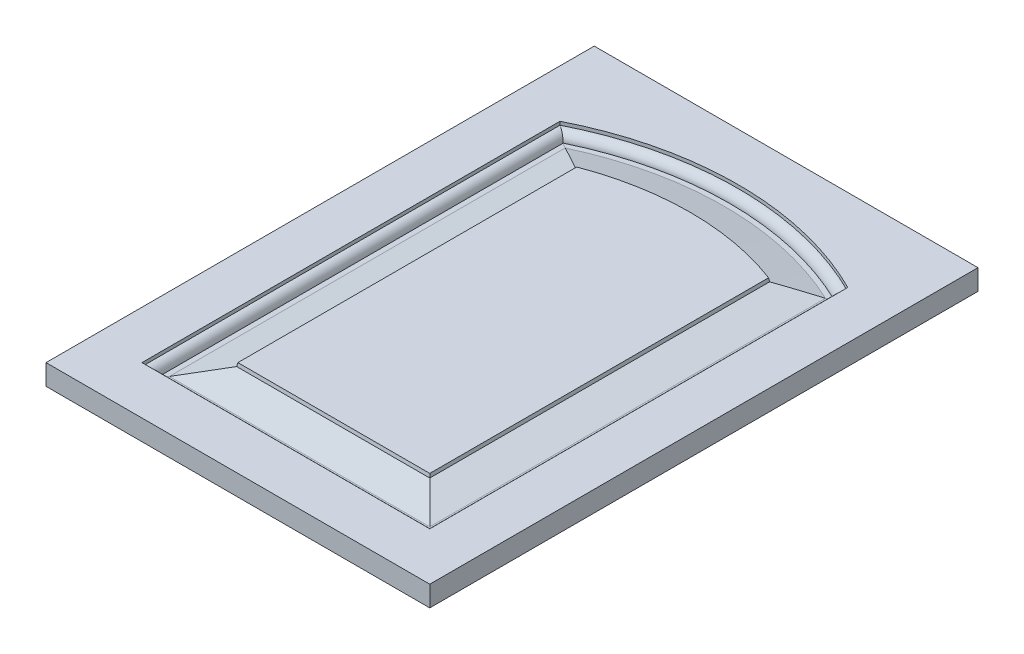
from build123d import *

# Parameters (mm, degrees)
SKETCH1_W           = 355.6
SKETCH1_H           = 508
BOSS_EXTRUDE1_DEPTH = 19.05


with BuildPart() as part:
    # Sketch1 → Boss-Extrude1 (new body)
    with BuildSketch(Plane(origin=(0, 0, 0), x_dir=(1, 0, 0), z_dir=(0, 1, 0))):
        with Locations((0, 254)):
            Rectangle(SKETCH1_W, SKETCH1_H)
    extrude(amount=BOSS_EXTRUDE1_DEPTH)

    # Cut-Sweep1: sweep along a path in Path
    with BuildLine(Plane(origin=(0, 19.05, 0), x_dir=(1, 0, 0), z_dir=(0, 1, 0))) as cut_sweep1_path:
        Line((-133.35, 431.8), (-133.35, 44.45))
        Line((-133.35, 44.45), (133.35, 44.45))
        Line((133.35, 44.45), (133.35, 431.8))
        ThreePointArc((133.35, 431.8), (0, 463.55), (-133.35, 431.8))
    # Profile → Cut-Sweep1 (sweep, cut)
    with BuildSketch(Plane(origin=(125.796884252, 12.162154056, -44.45), x_dir=(-1, 0, 0), z_dir=(0, 0, 1))):
        with BuildLine():
            Line((-7.553115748, -6.887845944), (-7.553115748, -3.712845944))
            ThreePointArc((-7.553115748, -3.712845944), (-1.940455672, -1.38800602), (0.384384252, 4.224654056))
            Line((0.384384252, 4.224654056), (5.146884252, 4.224654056))
            Line((5.146884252, 4.224654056), (36.337046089, -3.712845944))
            Line((36.337046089, -3.712845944), (36.896884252, -6.887845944))
            Line((36.896884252, -6.887845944), (-7.553115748, -6.887845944))
        make_face()
    sweep(path=cut_sweep1_path.line, transition=Transition.RIGHT, mode=Mode.SUBTRACT)


solid = part.part
